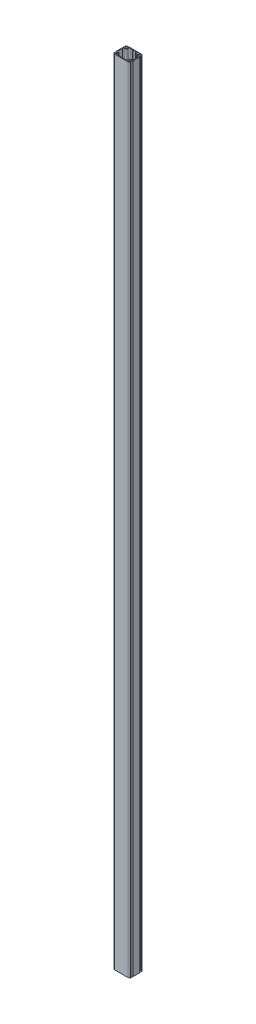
from build123d import *

# Parameters (mm, degrees)
SALIENTE_EXTRUIR1_DEPTH = 4753


with BuildPart() as part:
    # Croquis1 → Saliente-Extruir1 (new body)
    with BuildSketch(Plane(origin=(0, 0, 0), x_dir=(1, 0, 0), z_dir=(0, 1, 0))):
        with BuildLine():
            Line((39.5, -51.654327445), (-39.5, -51.654327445))
            ThreePointArc((-39.5, -51.654327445), (-45.378848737, -49.854277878), (-49.242036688, -45.071306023))
            ThreePointArc((-49.242036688, -45.071306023), (-48.132501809, -42.469588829), (-45.530784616, -43.579123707))
            ThreePointArc((-45.530784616, -43.579123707), (-33.301534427, -43.111116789), (-43.045454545, -35.706414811))
            ThreePointArc((-43.045454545, -35.706414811), (-47.645290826, -35.890503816), (-50, -31.934782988))
            Line((-50, -31.934782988), (-50, 8.626128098))
            ThreePointArc((-50, 8.626128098), (-47.645290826, 12.581848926), (-43.045454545, 12.397759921))
            ThreePointArc((-43.045454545, 12.397759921), (-33.301534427, 19.8024619), (-45.530784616, 20.270468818))
            ThreePointArc((-45.530784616, 20.270468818), (-48.132501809, 19.16093394), (-49.242036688, 21.762651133))
            ThreePointArc((-49.242036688, 21.762651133), (-45.378848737, 26.545622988), (-39.5, 28.345672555))
            Line((-39.5, 28.345672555), (39.5, 28.345672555))
            ThreePointArc((39.5, 28.345672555), (45.378848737, 26.545622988), (49.242036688, 21.762651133))
            ThreePointArc((49.242036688, 21.762651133), (48.132501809, 19.16093394), (45.530784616, 20.270468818))
            ThreePointArc((45.530784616, 20.270468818), (33.301534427, 19.8024619), (43.045454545, 12.397759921))
            ThreePointArc((43.045454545, 12.397759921), (47.645290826, 12.581848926), (50, 8.626128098))
            Line((50, 8.626128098), (50, -31.934782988))
            ThreePointArc((50, -31.934782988), (47.645290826, -35.890503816), (43.045454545, -35.706414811))
            ThreePointArc((43.045454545, -35.706414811), (33.301534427, -43.111116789), (45.530784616, -43.579123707))
            ThreePointArc((45.530784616, -43.579123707), (48.132501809, -42.469588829), (49.242036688, -45.071306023))
            ThreePointArc((49.242036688, -45.071306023), (45.378848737, -49.854277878), (39.5, -51.654327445))
        make_face()
        with BuildLine():
            Line((22.5, 24.345672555), (12.5, 24.345672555))
            Line((12.5, 24.345672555), (11, 22.845672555))
            Line((11, 22.845672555), (8, 22.845672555))
            Line((8, 22.845672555), (6.5, 24.345672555))
            Line((6.5, 24.345672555), (-6.5, 24.345672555))
            Line((-6.5, 24.345672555), (-8, 22.845672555))
            Line((-8, 22.845672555), (-11, 22.845672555))
            Line((-11, 22.845672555), (-12.5, 24.345672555))
            Line((-12.5, 24.345672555), (-22.5, 24.345672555))
            ThreePointArc((-22.5, 24.345672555), (-27.096194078, 22.441866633), (-29, 17.845672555))
            ThreePointArc((-29, 17.845672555), (-32.075378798, 10.421051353), (-39.5, 7.345672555))
            ThreePointArc((-39.5, 7.345672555), (-44.096194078, 5.441866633), (-46, 0.845672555))
            Line((-46, 0.845672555), (-46, -24.154327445))
            ThreePointArc((-46, -24.154327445), (-44.096194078, -28.750521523), (-39.5, -30.654327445))
            ThreePointArc((-39.5, -30.654327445), (-32.075378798, -33.729706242), (-29, -41.154327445))
            ThreePointArc((-29, -41.154327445), (-27.096194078, -45.750521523), (-22.5, -47.654327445))
            Line((-22.5, -47.654327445), (-12.5, -47.654327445))
            Line((-12.5, -47.654327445), (-11, -46.154327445))
            Line((-11, -46.154327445), (-8, -46.154327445))
            Line((-8, -46.154327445), (-6.5, -47.654327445))
            Line((-6.5, -47.654327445), (6.5, -47.654327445))
            Line((6.5, -47.654327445), (8, -46.154327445))
            Line((8, -46.154327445), (11, -46.154327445))
            Line((11, -46.154327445), (12.5, -47.654327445))
            Line((12.5, -47.654327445), (22.5, -47.654327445))
            ThreePointArc((22.5, -47.654327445), (27.096194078, -45.750521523), (29, -41.154327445))
            ThreePointArc((29, -41.154327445), (32.075378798, -33.729706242), (39.5, -30.654327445))
            ThreePointArc((39.5, -30.654327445), (44.096194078, -28.750521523), (46, -24.154327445))
            Line((46, -24.154327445), (46, 0.845672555))
            ThreePointArc((46, 0.845672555), (44.096194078, 5.441866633), (39.5, 7.345672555))
            ThreePointArc((39.5, 7.345672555), (32.075378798, 10.421051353), (29, 17.845672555))
            ThreePointArc((29, 17.845672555), (27.096194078, 22.441866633), (22.5, 24.345672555))
        make_face(mode=Mode.SUBTRACT)
    extrude(amount=SALIENTE_EXTRUIR1_DEPTH)


solid = part.part
